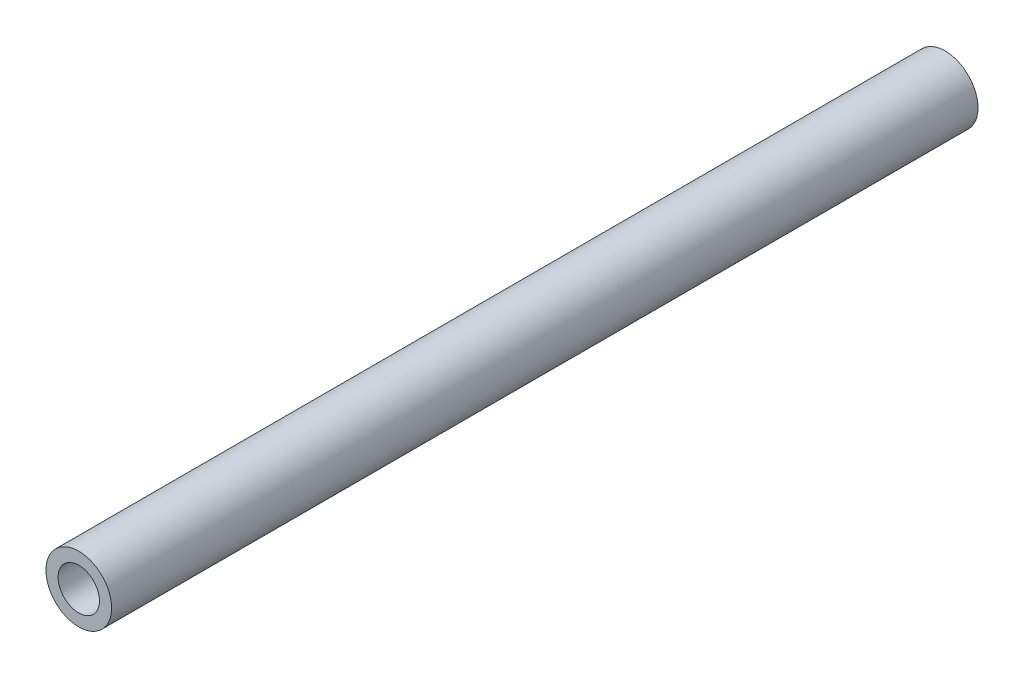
ISO-10303-21;
HEADER;
FILE_DESCRIPTION(('STEP AP214'),'2;1');
FILE_NAME('part.step','',(''),(''),'','','');
FILE_SCHEMA(('AUTOMOTIVE_DESIGN { 1 0 10303 214 1 1 1 1 }'));
ENDSEC;
DATA;
#1=APPLICATION_CONTEXT('core data for automotive mechanical design processes');
#2=APPLICATION_PROTOCOL_DEFINITION('international standard','automotive_design',2000,#1);
#3=PRODUCT_CONTEXT('',#1,'mechanical');
#4=PRODUCT('Part','Part','',(#3));
#5=PRODUCT_RELATED_PRODUCT_CATEGORY('part','',(#4));
#6=PRODUCT_DEFINITION_FORMATION('','',#4);
#7=PRODUCT_DEFINITION_CONTEXT('part definition',#1,'design');
#8=PRODUCT_DEFINITION('design','',#6,#7);
#9=PRODUCT_DEFINITION_SHAPE('','',#8);
#10=(LENGTH_UNIT() NAMED_UNIT(*) SI_UNIT(.MILLI.,.METRE.));
#11=(NAMED_UNIT(*) PLANE_ANGLE_UNIT() SI_UNIT($,.RADIAN.));
#12=(NAMED_UNIT(*) SI_UNIT($,.STERADIAN.) SOLID_ANGLE_UNIT());
#13=UNCERTAINTY_MEASURE_WITH_UNIT(LENGTH_MEASURE(1.E-05),#10,'distance_accuracy_value','');
#14=(GEOMETRIC_REPRESENTATION_CONTEXT(3) GLOBAL_UNCERTAINTY_ASSIGNED_CONTEXT((#13)) GLOBAL_UNIT_ASSIGNED_CONTEXT((#10,
#11,#12)) REPRESENTATION_CONTEXT('',''));
#15=CARTESIAN_POINT('',(0.,0.,0.));
#16=DIRECTION('',(0.,0.,1.));
#17=DIRECTION('',(1.,0.,0.));
#18=AXIS2_PLACEMENT_3D('',#15,#16,#17);
#19=CARTESIAN_POINT('',(97.5756239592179,-340.286640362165,92.7616561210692));
#20=DIRECTION('',(0.,0.,-1.));
#21=DIRECTION('',(-1.,0.,0.));
#22=AXIS2_PLACEMENT_3D('',#19,#20,#21);
#23=CYLINDRICAL_SURFACE('',#22,3.175);
#24=CARTESIAN_POINT('',(97.5756239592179,-340.286640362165,0.));
#25=DIRECTION('',(0.,0.,1.));
#26=DIRECTION('',(1.,0.,0.));
#27=AXIS2_PLACEMENT_3D('',#24,#25,#26);
#28=CIRCLE('',#27,3.175);
#29=CARTESIAN_POINT('',(100.750623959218,-340.286640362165,0.));
#30=VERTEX_POINT('',#29);
#31=EDGE_CURVE('E39',#30,#30,#28,.T.);
#32=ORIENTED_EDGE('',*,*,#31,.T.);
#33=EDGE_LOOP('',(#32));
#34=FACE_BOUND('',#33,.T.);
#35=CARTESIAN_POINT('',(97.5756239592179,-340.286640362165,83.7814));
#36=DIRECTION('',(0.,0.,1.));
#37=DIRECTION('',(1.,0.,0.));
#38=AXIS2_PLACEMENT_3D('',#35,#36,#37);
#39=CIRCLE('',#38,3.175);
#40=CARTESIAN_POINT('',(100.750623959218,-340.286640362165,83.7814));
#41=VERTEX_POINT('',#40);
#42=EDGE_CURVE('E10',#41,#41,#39,.T.);
#43=ORIENTED_EDGE('',*,*,#42,.F.);
#44=EDGE_LOOP('',(#43));
#45=FACE_BOUND('',#44,.T.);
#46=ADVANCED_FACE('F28',(#34,#45),#23,.T.);
#47=CARTESIAN_POINT('',(97.5756239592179,-340.286640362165,0.));
#48=DIRECTION('',(0.,0.,1.));
#49=DIRECTION('',(1.,0.,0.));
#50=AXIS2_PLACEMENT_3D('',#47,#48,#49);
#51=PLANE('',#50);
#52=ORIENTED_EDGE('',*,*,#31,.F.);
#53=EDGE_LOOP('',(#52));
#54=FACE_BOUND('',#53,.T.);
#55=CARTESIAN_POINT('',(97.5756239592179,-340.286640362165,0.));
#56=DIRECTION('',(0.,0.,1.));
#57=DIRECTION('',(1.,0.,0.));
#58=AXIS2_PLACEMENT_3D('',#55,#56,#57);
#59=CIRCLE('',#58,2.00000000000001);
#60=CARTESIAN_POINT('',(99.5756239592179,-340.286640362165,0.));
#61=VERTEX_POINT('',#60);
#62=EDGE_CURVE('E41',#61,#61,#59,.T.);
#63=ORIENTED_EDGE('',*,*,#62,.T.);
#64=EDGE_LOOP('',(#63));
#65=FACE_BOUND('',#64,.T.);
#66=ADVANCED_FACE('F48',(#54,#65),#51,.F.);
#67=CARTESIAN_POINT('',(97.5756239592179,-340.286640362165,92.7616561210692));
#68=DIRECTION('',(0.,0.,-1.));
#69=DIRECTION('',(-1.,0.,0.));
#70=AXIS2_PLACEMENT_3D('',#67,#68,#69);
#71=CYLINDRICAL_SURFACE('',#70,2.00000000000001);
#72=ORIENTED_EDGE('',*,*,#62,.F.);
#73=EDGE_LOOP('',(#72));
#74=FACE_BOUND('',#73,.T.);
#75=CARTESIAN_POINT('',(97.5756239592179,-340.286640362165,83.7814));
#76=DIRECTION('',(0.,0.,1.));
#77=DIRECTION('',(1.,0.,0.));
#78=AXIS2_PLACEMENT_3D('',#75,#76,#77);
#79=CIRCLE('',#78,2.00000000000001);
#80=CARTESIAN_POINT('',(99.5756239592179,-340.286640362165,83.7814));
#81=VERTEX_POINT('',#80);
#82=EDGE_CURVE('E31',#81,#81,#79,.T.);
#83=ORIENTED_EDGE('',*,*,#82,.T.);
#84=EDGE_LOOP('',(#83));
#85=FACE_BOUND('',#84,.T.);
#86=ADVANCED_FACE('F51',(#74,#85),#71,.F.);
#87=CARTESIAN_POINT('',(98.678173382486,-344.131687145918,83.7814));
#88=DIRECTION('',(0.,0.,1.));
#89=DIRECTION('',(-0.961261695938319,-0.275637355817,0.));
#90=AXIS2_PLACEMENT_3D('',#87,#88,#89);
#91=PLANE('',#90);
#92=ORIENTED_EDGE('',*,*,#82,.F.);
#93=EDGE_LOOP('',(#92));
#94=FACE_BOUND('',#93,.T.);
#95=ORIENTED_EDGE('',*,*,#42,.T.);
#96=EDGE_LOOP('',(#95));
#97=FACE_BOUND('',#96,.T.);
#98=ADVANCED_FACE('F56',(#94,#97),#91,.T.);
#99=CLOSED_SHELL('',(#46,#66,#86,#98));
#100=MANIFOLD_SOLID_BREP('B2',#99);
#101=ADVANCED_BREP_SHAPE_REPRESENTATION('',(#18,#100),#14);
#102=SHAPE_DEFINITION_REPRESENTATION(#9,#101);
ENDSEC;
END-ISO-10303-21;
